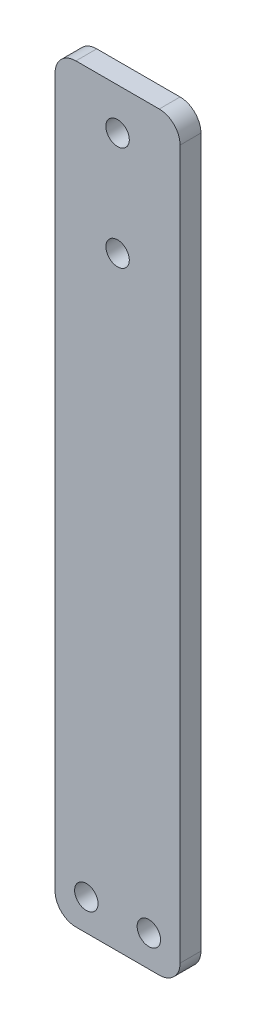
ISO-10303-21;
HEADER;
FILE_DESCRIPTION(('STEP AP214'),'2;1');
FILE_NAME('part.step','',(''),(''),'','','');
FILE_SCHEMA(('AUTOMOTIVE_DESIGN { 1 0 10303 214 1 1 1 1 }'));
ENDSEC;
DATA;
#1=APPLICATION_CONTEXT('core data for automotive mechanical design processes');
#2=APPLICATION_PROTOCOL_DEFINITION('international standard','automotive_design',2000,#1);
#3=PRODUCT_CONTEXT('',#1,'mechanical');
#4=PRODUCT('Part','Part','',(#3));
#5=PRODUCT_RELATED_PRODUCT_CATEGORY('part','',(#4));
#6=PRODUCT_DEFINITION_FORMATION('','',#4);
#7=PRODUCT_DEFINITION_CONTEXT('part definition',#1,'design');
#8=PRODUCT_DEFINITION('design','',#6,#7);
#9=PRODUCT_DEFINITION_SHAPE('','',#8);
#10=(LENGTH_UNIT() NAMED_UNIT(*) SI_UNIT(.MILLI.,.METRE.));
#11=(NAMED_UNIT(*) PLANE_ANGLE_UNIT() SI_UNIT($,.RADIAN.));
#12=(NAMED_UNIT(*) SI_UNIT($,.STERADIAN.) SOLID_ANGLE_UNIT());
#13=UNCERTAINTY_MEASURE_WITH_UNIT(LENGTH_MEASURE(1.E-05),#10,'distance_accuracy_value','');
#14=(GEOMETRIC_REPRESENTATION_CONTEXT(3) GLOBAL_UNCERTAINTY_ASSIGNED_CONTEXT((#13)) GLOBAL_UNIT_ASSIGNED_CONTEXT((#10,
#11,#12)) REPRESENTATION_CONTEXT('',''));
#15=CARTESIAN_POINT('',(0.,0.,0.));
#16=DIRECTION('',(0.,0.,1.));
#17=DIRECTION('',(1.,0.,0.));
#18=AXIS2_PLACEMENT_3D('',#15,#16,#17);
#19=CARTESIAN_POINT('',(0.,0.,6.35));
#20=DIRECTION('',(0.,0.,-1.));
#21=DIRECTION('',(-1.,0.,0.));
#22=AXIS2_PLACEMENT_3D('',#19,#20,#21);
#23=PLANE('',#22);
#24=CARTESIAN_POINT('',(-9.525,-104.775,6.35));
#25=DIRECTION('',(0.,0.,1.));
#26=DIRECTION('',(1.,0.,0.));
#27=AXIS2_PLACEMENT_3D('',#24,#25,#26);
#28=CIRCLE('',#27,3.571875);
#29=CARTESIAN_POINT('',(-5.953125,-104.775,6.35));
#30=VERTEX_POINT('',#29);
#31=EDGE_CURVE('E246',#30,#30,#28,.T.);
#32=ORIENTED_EDGE('',*,*,#31,.F.);
#33=EDGE_LOOP('',(#32));
#34=FACE_BOUND('',#33,.T.);
#35=CARTESIAN_POINT('',(9.525,-104.775,6.35));
#36=DIRECTION('',(0.,0.,1.));
#37=DIRECTION('',(1.,0.,0.));
#38=AXIS2_PLACEMENT_3D('',#35,#36,#37);
#39=CIRCLE('',#38,3.571875);
#40=CARTESIAN_POINT('',(13.096875,-104.775,6.35));
#41=VERTEX_POINT('',#40);
#42=EDGE_CURVE('E255',#41,#41,#39,.T.);
#43=ORIENTED_EDGE('',*,*,#42,.F.);
#44=EDGE_LOOP('',(#43));
#45=FACE_BOUND('',#44,.T.);
#46=DIRECTION('',(0.,-1.,0.));
#47=VECTOR('',#46,1.);
#48=CARTESIAN_POINT('',(-19.05,-114.3,6.35));
#49=LINE('',#48,#47);
#50=CARTESIAN_POINT('',(-19.05,107.95,6.35));
#51=VERTEX_POINT('',#50);
#52=CARTESIAN_POINT('',(-19.05,-107.95,6.35));
#53=VERTEX_POINT('',#52);
#54=EDGE_CURVE('E181',#51,#53,#49,.T.);
#55=ORIENTED_EDGE('',*,*,#54,.T.);
#56=CARTESIAN_POINT('',(-12.7,-107.95,6.35));
#57=DIRECTION('',(0.,0.,-1.));
#58=DIRECTION('',(-1.,0.,0.));
#59=AXIS2_PLACEMENT_3D('',#56,#57,#58);
#60=CIRCLE('',#59,6.35);
#61=CARTESIAN_POINT('',(-12.7,-114.3,6.35));
#62=VERTEX_POINT('',#61);
#63=EDGE_CURVE('E169',#53,#62,#60,.F.);
#64=ORIENTED_EDGE('',*,*,#63,.T.);
#65=DIRECTION('',(1.,0.,0.));
#66=VECTOR('',#65,1.);
#67=CARTESIAN_POINT('',(-19.05,-114.3,6.35));
#68=LINE('',#67,#66);
#69=CARTESIAN_POINT('',(12.7,-114.3,6.35));
#70=VERTEX_POINT('',#69);
#71=EDGE_CURVE('E127',#62,#70,#68,.T.);
#72=ORIENTED_EDGE('',*,*,#71,.T.);
#73=CARTESIAN_POINT('',(12.7,-107.95,6.35));
#74=DIRECTION('',(0.,0.,-1.));
#75=DIRECTION('',(-1.,0.,0.));
#76=AXIS2_PLACEMENT_3D('',#73,#74,#75);
#77=CIRCLE('',#76,6.35);
#78=CARTESIAN_POINT('',(19.05,-107.95,6.35));
#79=VERTEX_POINT('',#78);
#80=EDGE_CURVE('E166',#70,#79,#77,.F.);
#81=ORIENTED_EDGE('',*,*,#80,.T.);
#82=DIRECTION('',(0.,1.,0.));
#83=VECTOR('',#82,1.);
#84=CARTESIAN_POINT('',(19.05,-114.3,6.35));
#85=LINE('',#84,#83);
#86=CARTESIAN_POINT('',(19.05,107.95,6.35));
#87=VERTEX_POINT('',#86);
#88=EDGE_CURVE('E136',#79,#87,#85,.T.);
#89=ORIENTED_EDGE('',*,*,#88,.T.);
#90=CARTESIAN_POINT('',(12.7,107.95,6.35));
#91=DIRECTION('',(0.,0.,-1.));
#92=DIRECTION('',(-1.,0.,0.));
#93=AXIS2_PLACEMENT_3D('',#90,#91,#92);
#94=CIRCLE('',#93,6.35);
#95=CARTESIAN_POINT('',(12.7,114.3,6.35));
#96=VERTEX_POINT('',#95);
#97=EDGE_CURVE('E61',#87,#96,#94,.F.);
#98=ORIENTED_EDGE('',*,*,#97,.T.);
#99=DIRECTION('',(-1.,0.,0.));
#100=VECTOR('',#99,1.);
#101=CARTESIAN_POINT('',(-19.05,114.3,6.35));
#102=LINE('',#101,#100);
#103=CARTESIAN_POINT('',(-12.7,114.3,6.35));
#104=VERTEX_POINT('',#103);
#105=EDGE_CURVE('E141',#96,#104,#102,.T.);
#106=ORIENTED_EDGE('',*,*,#105,.T.);
#107=CARTESIAN_POINT('',(-12.7,107.95,6.35));
#108=DIRECTION('',(0.,0.,-1.));
#109=DIRECTION('',(-1.,0.,0.));
#110=AXIS2_PLACEMENT_3D('',#107,#108,#109);
#111=CIRCLE('',#110,6.35);
#112=EDGE_CURVE('E161',#104,#51,#111,.F.);
#113=ORIENTED_EDGE('',*,*,#112,.T.);
#114=EDGE_LOOP('',(#55,#64,#72,#81,#89,#98,#106,#113));
#115=FACE_BOUND('',#114,.T.);
#116=CARTESIAN_POINT('',(0.,101.6,6.35));
#117=DIRECTION('',(0.,0.,1.));
#118=DIRECTION('',(1.,0.,0.));
#119=AXIS2_PLACEMENT_3D('',#116,#117,#118);
#120=CIRCLE('',#119,3.571875);
#121=CARTESIAN_POINT('',(3.57187499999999,101.6,6.35));
#122=VERTEX_POINT('',#121);
#123=EDGE_CURVE('E193',#122,#122,#120,.T.);
#124=ORIENTED_EDGE('',*,*,#123,.F.);
#125=EDGE_LOOP('',(#124));
#126=FACE_BOUND('',#125,.T.);
#127=CARTESIAN_POINT('',(0.,69.85,6.35));
#128=DIRECTION('',(0.,0.,1.));
#129=DIRECTION('',(1.,0.,0.));
#130=AXIS2_PLACEMENT_3D('',#127,#128,#129);
#131=CIRCLE('',#130,3.571875);
#132=CARTESIAN_POINT('',(3.571875,69.85,6.35));
#133=VERTEX_POINT('',#132);
#134=EDGE_CURVE('E261',#133,#133,#131,.T.);
#135=ORIENTED_EDGE('',*,*,#134,.F.);
#136=EDGE_LOOP('',(#135));
#137=FACE_BOUND('',#136,.T.);
#138=ADVANCED_FACE('F39',(#34,#45,#115,#126,#137),#23,.F.);
#139=CARTESIAN_POINT('',(0.,0.,0.));
#140=DIRECTION('',(0.,0.,-1.));
#141=DIRECTION('',(-1.,0.,0.));
#142=AXIS2_PLACEMENT_3D('',#139,#140,#141);
#143=PLANE('',#142);
#144=CARTESIAN_POINT('',(-9.525,-104.775,0.));
#145=DIRECTION('',(0.,0.,1.));
#146=DIRECTION('',(1.,0.,0.));
#147=AXIS2_PLACEMENT_3D('',#144,#145,#146);
#148=CIRCLE('',#147,3.571875);
#149=CARTESIAN_POINT('',(-5.953125,-104.775,0.));
#150=VERTEX_POINT('',#149);
#151=EDGE_CURVE('E244',#150,#150,#148,.T.);
#152=ORIENTED_EDGE('',*,*,#151,.T.);
#153=EDGE_LOOP('',(#152));
#154=FACE_BOUND('',#153,.T.);
#155=CARTESIAN_POINT('',(9.525,-104.775,0.));
#156=DIRECTION('',(0.,0.,1.));
#157=DIRECTION('',(1.,0.,0.));
#158=AXIS2_PLACEMENT_3D('',#155,#156,#157);
#159=CIRCLE('',#158,3.571875);
#160=CARTESIAN_POINT('',(13.096875,-104.775,0.));
#161=VERTEX_POINT('',#160);
#162=EDGE_CURVE('E248',#161,#161,#159,.T.);
#163=ORIENTED_EDGE('',*,*,#162,.T.);
#164=EDGE_LOOP('',(#163));
#165=FACE_BOUND('',#164,.T.);
#166=CARTESIAN_POINT('',(0.,101.6,0.));
#167=DIRECTION('',(0.,0.,1.));
#168=DIRECTION('',(1.,0.,0.));
#169=AXIS2_PLACEMENT_3D('',#166,#167,#168);
#170=CIRCLE('',#169,3.571875);
#171=CARTESIAN_POINT('',(3.57187499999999,101.6,0.));
#172=VERTEX_POINT('',#171);
#173=EDGE_CURVE('E265',#172,#172,#170,.T.);
#174=ORIENTED_EDGE('',*,*,#173,.T.);
#175=EDGE_LOOP('',(#174));
#176=FACE_BOUND('',#175,.T.);
#177=DIRECTION('',(1.,0.,0.));
#178=VECTOR('',#177,1.);
#179=CARTESIAN_POINT('',(-19.05,-114.3,0.));
#180=LINE('',#179,#178);
#181=CARTESIAN_POINT('',(-12.7,-114.3,0.));
#182=VERTEX_POINT('',#181);
#183=CARTESIAN_POINT('',(12.7,-114.3,0.));
#184=VERTEX_POINT('',#183);
#185=EDGE_CURVE('E124',#182,#184,#180,.T.);
#186=ORIENTED_EDGE('',*,*,#185,.F.);
#187=CARTESIAN_POINT('',(-12.7,-107.95,0.));
#188=DIRECTION('',(0.,0.,-1.));
#189=DIRECTION('',(-1.,0.,0.));
#190=AXIS2_PLACEMENT_3D('',#187,#188,#189);
#191=CIRCLE('',#190,6.35);
#192=CARTESIAN_POINT('',(-19.05,-107.95,0.));
#193=VERTEX_POINT('',#192);
#194=EDGE_CURVE('E106',#182,#193,#191,.T.);
#195=ORIENTED_EDGE('',*,*,#194,.T.);
#196=DIRECTION('',(0.,-1.,0.));
#197=VECTOR('',#196,1.);
#198=CARTESIAN_POINT('',(-19.05,-114.3,0.));
#199=LINE('',#198,#197);
#200=CARTESIAN_POINT('',(-19.05,107.95,0.));
#201=VERTEX_POINT('',#200);
#202=EDGE_CURVE('E137',#201,#193,#199,.T.);
#203=ORIENTED_EDGE('',*,*,#202,.F.);
#204=CARTESIAN_POINT('',(-12.7,107.95,0.));
#205=DIRECTION('',(0.,0.,-1.));
#206=DIRECTION('',(-1.,0.,0.));
#207=AXIS2_PLACEMENT_3D('',#204,#205,#206);
#208=CIRCLE('',#207,6.35);
#209=CARTESIAN_POINT('',(-12.7,114.3,0.));
#210=VERTEX_POINT('',#209);
#211=EDGE_CURVE('E129',#201,#210,#208,.T.);
#212=ORIENTED_EDGE('',*,*,#211,.T.);
#213=DIRECTION('',(-1.,0.,0.));
#214=VECTOR('',#213,1.);
#215=CARTESIAN_POINT('',(-19.05,114.3,0.));
#216=LINE('',#215,#214);
#217=CARTESIAN_POINT('',(12.7,114.3,0.));
#218=VERTEX_POINT('',#217);
#219=EDGE_CURVE('E143',#218,#210,#216,.T.);
#220=ORIENTED_EDGE('',*,*,#219,.F.);
#221=CARTESIAN_POINT('',(12.7,107.95,0.));
#222=DIRECTION('',(0.,0.,-1.));
#223=DIRECTION('',(-1.,0.,0.));
#224=AXIS2_PLACEMENT_3D('',#221,#222,#223);
#225=CIRCLE('',#224,6.35);
#226=CARTESIAN_POINT('',(19.05,107.95,0.));
#227=VERTEX_POINT('',#226);
#228=EDGE_CURVE('E151',#218,#227,#225,.T.);
#229=ORIENTED_EDGE('',*,*,#228,.T.);
#230=DIRECTION('',(0.,1.,0.));
#231=VECTOR('',#230,1.);
#232=CARTESIAN_POINT('',(19.05,-114.3,0.));
#233=LINE('',#232,#231);
#234=CARTESIAN_POINT('',(19.05,-107.95,0.));
#235=VERTEX_POINT('',#234);
#236=EDGE_CURVE('E190',#235,#227,#233,.T.);
#237=ORIENTED_EDGE('',*,*,#236,.F.);
#238=CARTESIAN_POINT('',(12.7,-107.95,0.));
#239=DIRECTION('',(0.,0.,-1.));
#240=DIRECTION('',(-1.,0.,0.));
#241=AXIS2_PLACEMENT_3D('',#238,#239,#240);
#242=CIRCLE('',#241,6.35);
#243=EDGE_CURVE('E118',#235,#184,#242,.T.);
#244=ORIENTED_EDGE('',*,*,#243,.T.);
#245=EDGE_LOOP('',(#186,#195,#203,#212,#220,#229,#237,#244));
#246=FACE_BOUND('',#245,.T.);
#247=CARTESIAN_POINT('',(0.,69.85,0.));
#248=DIRECTION('',(0.,0.,1.));
#249=DIRECTION('',(1.,0.,0.));
#250=AXIS2_PLACEMENT_3D('',#247,#248,#249);
#251=CIRCLE('',#250,3.571875);
#252=CARTESIAN_POINT('',(3.571875,69.85,0.));
#253=VERTEX_POINT('',#252);
#254=EDGE_CURVE('E252',#253,#253,#251,.T.);
#255=ORIENTED_EDGE('',*,*,#254,.T.);
#256=EDGE_LOOP('',(#255));
#257=FACE_BOUND('',#256,.T.);
#258=ADVANCED_FACE('F132',(#154,#165,#176,#246,#257),#143,.T.);
#259=CARTESIAN_POINT('',(19.05,-114.3,6.35));
#260=DIRECTION('',(-1.,0.,0.));
#261=DIRECTION('',(0.,0.,1.));
#262=AXIS2_PLACEMENT_3D('',#259,#260,#261);
#263=PLANE('',#262);
#264=ORIENTED_EDGE('',*,*,#88,.F.);
#265=DIRECTION('',(0.,0.,-1.));
#266=VECTOR('',#265,1.);
#267=CARTESIAN_POINT('',(19.05,-107.95,6.35));
#268=LINE('',#267,#266);
#269=EDGE_CURVE('E175',#79,#235,#268,.T.);
#270=ORIENTED_EDGE('',*,*,#269,.T.);
#271=ORIENTED_EDGE('',*,*,#236,.T.);
#272=DIRECTION('',(0.,0.,-1.));
#273=VECTOR('',#272,1.);
#274=CARTESIAN_POINT('',(19.05,107.95,6.35));
#275=LINE('',#274,#273);
#276=EDGE_CURVE('E172',#227,#87,#275,.F.);
#277=ORIENTED_EDGE('',*,*,#276,.T.);
#278=EDGE_LOOP('',(#264,#270,#271,#277));
#279=FACE_BOUND('',#278,.T.);
#280=ADVANCED_FACE('F212',(#279),#263,.F.);
#281=CARTESIAN_POINT('',(-19.05,114.3,6.35));
#282=DIRECTION('',(0.,-1.,0.));
#283=DIRECTION('',(0.,0.,-1.));
#284=AXIS2_PLACEMENT_3D('',#281,#282,#283);
#285=PLANE('',#284);
#286=ORIENTED_EDGE('',*,*,#105,.F.);
#287=DIRECTION('',(0.,0.,-1.));
#288=VECTOR('',#287,1.);
#289=CARTESIAN_POINT('',(12.7,114.3,6.35));
#290=LINE('',#289,#288);
#291=EDGE_CURVE('E11',#96,#218,#290,.T.);
#292=ORIENTED_EDGE('',*,*,#291,.T.);
#293=ORIENTED_EDGE('',*,*,#219,.T.);
#294=DIRECTION('',(0.,0.,-1.));
#295=VECTOR('',#294,1.);
#296=CARTESIAN_POINT('',(-12.7,114.3,6.35));
#297=LINE('',#296,#295);
#298=EDGE_CURVE('E48',#210,#104,#297,.F.);
#299=ORIENTED_EDGE('',*,*,#298,.T.);
#300=EDGE_LOOP('',(#286,#292,#293,#299));
#301=FACE_BOUND('',#300,.T.);
#302=ADVANCED_FACE('F196',(#301),#285,.F.);
#303=CARTESIAN_POINT('',(-19.05,-114.3,6.35));
#304=DIRECTION('',(1.,0.,0.));
#305=DIRECTION('',(0.,0.,-1.));
#306=AXIS2_PLACEMENT_3D('',#303,#304,#305);
#307=PLANE('',#306);
#308=ORIENTED_EDGE('',*,*,#202,.T.);
#309=DIRECTION('',(0.,0.,-1.));
#310=VECTOR('',#309,1.);
#311=CARTESIAN_POINT('',(-19.05,-107.95,6.35));
#312=LINE('',#311,#310);
#313=EDGE_CURVE('E111',#193,#53,#312,.F.);
#314=ORIENTED_EDGE('',*,*,#313,.T.);
#315=ORIENTED_EDGE('',*,*,#54,.F.);
#316=DIRECTION('',(0.,0.,-1.));
#317=VECTOR('',#316,1.);
#318=CARTESIAN_POINT('',(-19.05,107.95,6.35));
#319=LINE('',#318,#317);
#320=EDGE_CURVE('E117',#51,#201,#319,.T.);
#321=ORIENTED_EDGE('',*,*,#320,.T.);
#322=EDGE_LOOP('',(#308,#314,#315,#321));
#323=FACE_BOUND('',#322,.T.);
#324=ADVANCED_FACE('F203',(#323),#307,.F.);
#325=CARTESIAN_POINT('',(-19.05,-114.3,6.35));
#326=DIRECTION('',(0.,1.,0.));
#327=DIRECTION('',(0.,0.,1.));
#328=AXIS2_PLACEMENT_3D('',#325,#326,#327);
#329=PLANE('',#328);
#330=ORIENTED_EDGE('',*,*,#71,.F.);
#331=DIRECTION('',(0.,0.,-1.));
#332=VECTOR('',#331,1.);
#333=CARTESIAN_POINT('',(-12.7,-114.3,6.35));
#334=LINE('',#333,#332);
#335=EDGE_CURVE('E110',#62,#182,#334,.T.);
#336=ORIENTED_EDGE('',*,*,#335,.T.);
#337=ORIENTED_EDGE('',*,*,#185,.T.);
#338=DIRECTION('',(0.,0.,-1.));
#339=VECTOR('',#338,1.);
#340=CARTESIAN_POINT('',(12.7,-114.3,6.35));
#341=LINE('',#340,#339);
#342=EDGE_CURVE('E130',#184,#70,#341,.F.);
#343=ORIENTED_EDGE('',*,*,#342,.T.);
#344=EDGE_LOOP('',(#330,#336,#337,#343));
#345=FACE_BOUND('',#344,.T.);
#346=ADVANCED_FACE('F123',(#345),#329,.F.);
#347=CARTESIAN_POINT('',(0.,101.6,6.35));
#348=DIRECTION('',(0.,0.,-1.));
#349=DIRECTION('',(-1.,0.,0.));
#350=AXIS2_PLACEMENT_3D('',#347,#348,#349);
#351=CYLINDRICAL_SURFACE('',#350,3.571875);
#352=ORIENTED_EDGE('',*,*,#123,.T.);
#353=EDGE_LOOP('',(#352));
#354=FACE_BOUND('',#353,.T.);
#355=ORIENTED_EDGE('',*,*,#173,.F.);
#356=EDGE_LOOP('',(#355));
#357=FACE_BOUND('',#356,.T.);
#358=ADVANCED_FACE('F210',(#354,#357),#351,.F.);
#359=CARTESIAN_POINT('',(0.,69.85,6.35));
#360=DIRECTION('',(0.,0.,-1.));
#361=DIRECTION('',(-1.,0.,0.));
#362=AXIS2_PLACEMENT_3D('',#359,#360,#361);
#363=CYLINDRICAL_SURFACE('',#362,3.571875);
#364=ORIENTED_EDGE('',*,*,#134,.T.);
#365=EDGE_LOOP('',(#364));
#366=FACE_BOUND('',#365,.T.);
#367=ORIENTED_EDGE('',*,*,#254,.F.);
#368=EDGE_LOOP('',(#367));
#369=FACE_BOUND('',#368,.T.);
#370=ADVANCED_FACE('F227',(#366,#369),#363,.F.);
#371=CARTESIAN_POINT('',(-12.7,-107.95,6.35));
#372=DIRECTION('',(0.,0.,-1.));
#373=DIRECTION('',(-1.,0.,0.));
#374=AXIS2_PLACEMENT_3D('',#371,#372,#373);
#375=CYLINDRICAL_SURFACE('',#374,6.35);
#376=ORIENTED_EDGE('',*,*,#63,.F.);
#377=ORIENTED_EDGE('',*,*,#313,.F.);
#378=ORIENTED_EDGE('',*,*,#194,.F.);
#379=ORIENTED_EDGE('',*,*,#335,.F.);
#380=EDGE_LOOP('',(#376,#377,#378,#379));
#381=FACE_BOUND('',#380,.T.);
#382=ADVANCED_FACE('F109',(#381),#375,.T.);
#383=CARTESIAN_POINT('',(12.7,-107.95,6.35));
#384=DIRECTION('',(0.,0.,-1.));
#385=DIRECTION('',(-1.,0.,0.));
#386=AXIS2_PLACEMENT_3D('',#383,#384,#385);
#387=CYLINDRICAL_SURFACE('',#386,6.35);
#388=ORIENTED_EDGE('',*,*,#80,.F.);
#389=ORIENTED_EDGE('',*,*,#342,.F.);
#390=ORIENTED_EDGE('',*,*,#243,.F.);
#391=ORIENTED_EDGE('',*,*,#269,.F.);
#392=EDGE_LOOP('',(#388,#389,#390,#391));
#393=FACE_BOUND('',#392,.T.);
#394=ADVANCED_FACE('F302',(#393),#387,.T.);
#395=CARTESIAN_POINT('',(12.7,107.95,6.35));
#396=DIRECTION('',(0.,0.,-1.));
#397=DIRECTION('',(-1.,0.,0.));
#398=AXIS2_PLACEMENT_3D('',#395,#396,#397);
#399=CYLINDRICAL_SURFACE('',#398,6.35);
#400=ORIENTED_EDGE('',*,*,#97,.F.);
#401=ORIENTED_EDGE('',*,*,#276,.F.);
#402=ORIENTED_EDGE('',*,*,#228,.F.);
#403=ORIENTED_EDGE('',*,*,#291,.F.);
#404=EDGE_LOOP('',(#400,#401,#402,#403));
#405=FACE_BOUND('',#404,.T.);
#406=ADVANCED_FACE('F296',(#405),#399,.T.);
#407=CARTESIAN_POINT('',(-12.7,107.95,6.35));
#408=DIRECTION('',(0.,0.,-1.));
#409=DIRECTION('',(-1.,0.,0.));
#410=AXIS2_PLACEMENT_3D('',#407,#408,#409);
#411=CYLINDRICAL_SURFACE('',#410,6.35);
#412=ORIENTED_EDGE('',*,*,#112,.F.);
#413=ORIENTED_EDGE('',*,*,#298,.F.);
#414=ORIENTED_EDGE('',*,*,#211,.F.);
#415=ORIENTED_EDGE('',*,*,#320,.F.);
#416=EDGE_LOOP('',(#412,#413,#414,#415));
#417=FACE_BOUND('',#416,.T.);
#418=ADVANCED_FACE('F41',(#417),#411,.T.);
#419=CARTESIAN_POINT('',(9.525,-104.775,0.));
#420=DIRECTION('',(0.,0.,1.));
#421=DIRECTION('',(1.,0.,0.));
#422=AXIS2_PLACEMENT_3D('',#419,#420,#421);
#423=CYLINDRICAL_SURFACE('',#422,3.571875);
#424=ORIENTED_EDGE('',*,*,#162,.F.);
#425=EDGE_LOOP('',(#424));
#426=FACE_BOUND('',#425,.T.);
#427=ORIENTED_EDGE('',*,*,#42,.T.);
#428=EDGE_LOOP('',(#427));
#429=FACE_BOUND('',#428,.T.);
#430=ADVANCED_FACE('F232',(#426,#429),#423,.F.);
#431=CARTESIAN_POINT('',(-9.525,-104.775,0.));
#432=DIRECTION('',(0.,0.,1.));
#433=DIRECTION('',(1.,0.,0.));
#434=AXIS2_PLACEMENT_3D('',#431,#432,#433);
#435=CYLINDRICAL_SURFACE('',#434,3.571875);
#436=ORIENTED_EDGE('',*,*,#151,.F.);
#437=EDGE_LOOP('',(#436));
#438=FACE_BOUND('',#437,.T.);
#439=ORIENTED_EDGE('',*,*,#31,.T.);
#440=EDGE_LOOP('',(#439));
#441=FACE_BOUND('',#440,.T.);
#442=ADVANCED_FACE('F235',(#438,#441),#435,.F.);
#443=CLOSED_SHELL('',(#138,#258,#280,#302,#324,#346,#358,#370,#382,#394,#406,#418,#430,#442));
#444=MANIFOLD_SOLID_BREP('B2',#443);
#445=ADVANCED_BREP_SHAPE_REPRESENTATION('',(#18,#444),#14);
#446=SHAPE_DEFINITION_REPRESENTATION(#9,#445);
ENDSEC;
END-ISO-10303-21;
